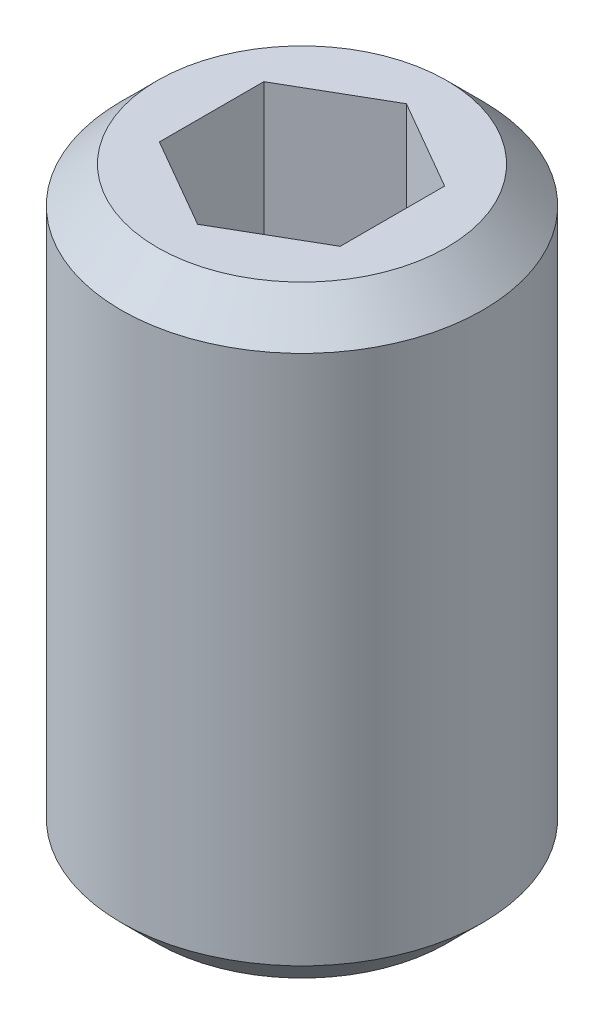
ISO-10303-21;
HEADER;
FILE_DESCRIPTION(('STEP AP214'),'2;1');
FILE_NAME('part.step','',(''),(''),'','','');
FILE_SCHEMA(('AUTOMOTIVE_DESIGN { 1 0 10303 214 1 1 1 1 }'));
ENDSEC;
DATA;
#1=APPLICATION_CONTEXT('core data for automotive mechanical design processes');
#2=APPLICATION_PROTOCOL_DEFINITION('international standard','automotive_design',2000,#1);
#3=PRODUCT_CONTEXT('',#1,'mechanical');
#4=PRODUCT('Part','Part','',(#3));
#5=PRODUCT_RELATED_PRODUCT_CATEGORY('part','',(#4));
#6=PRODUCT_DEFINITION_FORMATION('','',#4);
#7=PRODUCT_DEFINITION_CONTEXT('part definition',#1,'design');
#8=PRODUCT_DEFINITION('design','',#6,#7);
#9=PRODUCT_DEFINITION_SHAPE('','',#8);
#10=(LENGTH_UNIT() NAMED_UNIT(*) SI_UNIT(.MILLI.,.METRE.));
#11=(NAMED_UNIT(*) PLANE_ANGLE_UNIT() SI_UNIT($,.RADIAN.));
#12=(NAMED_UNIT(*) SI_UNIT($,.STERADIAN.) SOLID_ANGLE_UNIT());
#13=UNCERTAINTY_MEASURE_WITH_UNIT(LENGTH_MEASURE(1.E-05),#10,'distance_accuracy_value','');
#14=(GEOMETRIC_REPRESENTATION_CONTEXT(3) GLOBAL_UNCERTAINTY_ASSIGNED_CONTEXT((#13)) GLOBAL_UNIT_ASSIGNED_CONTEXT((#10,
#11,#12)) REPRESENTATION_CONTEXT('',''));
#15=CARTESIAN_POINT('',(0.,0.,0.));
#16=DIRECTION('',(0.,0.,1.));
#17=DIRECTION('',(1.,0.,0.));
#18=AXIS2_PLACEMENT_3D('',#15,#16,#17);
#19=CARTESIAN_POINT('',(0.,-5.,0.));
#20=DIRECTION('',(0.,1.,0.));
#21=DIRECTION('',(0.,0.,1.));
#22=AXIS2_PLACEMENT_3D('',#19,#20,#21);
#23=PLANE('',#22);
#24=CARTESIAN_POINT('',(0.,-5.,0.));
#25=DIRECTION('',(0.,1.,0.));
#26=DIRECTION('',(0.,0.,1.));
#27=AXIS2_PLACEMENT_3D('',#24,#25,#26);
#28=CIRCLE('',#27,1.2);
#29=CARTESIAN_POINT('',(0.,-5.,1.2));
#30=VERTEX_POINT('',#29);
#31=EDGE_CURVE('E139',#30,#30,#28,.F.);
#32=ORIENTED_EDGE('',*,*,#31,.T.);
#33=EDGE_LOOP('',(#32));
#34=FACE_BOUND('',#33,.T.);
#35=ADVANCED_FACE('F28',(#34),#23,.F.);
#36=CARTESIAN_POINT('',(0.,0.,0.));
#37=DIRECTION('',(0.,1.,0.));
#38=DIRECTION('',(0.,0.,1.));
#39=AXIS2_PLACEMENT_3D('',#36,#37,#38);
#40=CYLINDRICAL_SURFACE('',#39,1.5);
#41=CARTESIAN_POINT('',(0.,-0.300000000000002,0.));
#42=DIRECTION('',(0.,-1.,0.));
#43=DIRECTION('',(0.,0.,-1.));
#44=AXIS2_PLACEMENT_3D('',#41,#42,#43);
#45=CIRCLE('',#44,1.5);
#46=CARTESIAN_POINT('',(0.,-0.300000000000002,-1.5));
#47=VERTEX_POINT('',#46);
#48=EDGE_CURVE('E11',#47,#47,#45,.T.);
#49=ORIENTED_EDGE('',*,*,#48,.T.);
#50=EDGE_LOOP('',(#49));
#51=FACE_BOUND('',#50,.T.);
#52=CARTESIAN_POINT('',(0.,-4.7,0.));
#53=DIRECTION('',(0.,1.,0.));
#54=DIRECTION('',(0.,0.,1.));
#55=AXIS2_PLACEMENT_3D('',#52,#53,#54);
#56=CIRCLE('',#55,1.5);
#57=CARTESIAN_POINT('',(0.,-4.7,1.5));
#58=VERTEX_POINT('',#57);
#59=EDGE_CURVE('E130',#58,#58,#56,.T.);
#60=ORIENTED_EDGE('',*,*,#59,.T.);
#61=EDGE_LOOP('',(#60));
#62=FACE_BOUND('',#61,.T.);
#63=ADVANCED_FACE('F160',(#51,#62),#40,.T.);
#64=CARTESIAN_POINT('',(0.,0.,0.));
#65=DIRECTION('',(0.,-1.,0.));
#66=DIRECTION('',(0.,0.,-1.));
#67=AXIS2_PLACEMENT_3D('',#64,#65,#66);
#68=PLANE('',#67);
#69=DIRECTION('',(0.866025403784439,0.,-0.5));
#70=VECTOR('',#69,1.);
#71=CARTESIAN_POINT('',(0.,0.,0.866025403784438));
#72=LINE('',#71,#70);
#73=CARTESIAN_POINT('',(0.,0.,0.866025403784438));
#74=VERTEX_POINT('',#73);
#75=CARTESIAN_POINT('',(0.750000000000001,0.,0.43301270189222));
#76=VERTEX_POINT('',#75);
#77=EDGE_CURVE('E96',#74,#76,#72,.T.);
#78=ORIENTED_EDGE('',*,*,#77,.F.);
#79=DIRECTION('',(0.866025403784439,0.,0.5));
#80=VECTOR('',#79,1.);
#81=CARTESIAN_POINT('',(-0.749999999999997,0.,0.43301270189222));
#82=LINE('',#81,#80);
#83=CARTESIAN_POINT('',(-0.749999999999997,0.,0.43301270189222));
#84=VERTEX_POINT('',#83);
#85=EDGE_CURVE('E42',#84,#74,#82,.T.);
#86=ORIENTED_EDGE('',*,*,#85,.F.);
#87=DIRECTION('',(0.,0.,1.));
#88=VECTOR('',#87,1.);
#89=CARTESIAN_POINT('',(-0.749999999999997,0.,-0.433012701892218));
#90=LINE('',#89,#88);
#91=CARTESIAN_POINT('',(-0.749999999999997,0.,-0.433012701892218));
#92=VERTEX_POINT('',#91);
#93=EDGE_CURVE('E112',#92,#84,#90,.T.);
#94=ORIENTED_EDGE('',*,*,#93,.F.);
#95=DIRECTION('',(-0.866025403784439,0.,0.5));
#96=VECTOR('',#95,1.);
#97=CARTESIAN_POINT('',(0.,0.,-0.866025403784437));
#98=LINE('',#97,#96);
#99=CARTESIAN_POINT('',(0.,0.,-0.866025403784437));
#100=VERTEX_POINT('',#99);
#101=EDGE_CURVE('E106',#100,#92,#98,.T.);
#102=ORIENTED_EDGE('',*,*,#101,.F.);
#103=DIRECTION('',(-0.866025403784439,0.,-0.499999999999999));
#104=VECTOR('',#103,1.);
#105=CARTESIAN_POINT('',(0.750000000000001,0.,-0.433012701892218));
#106=LINE('',#105,#104);
#107=CARTESIAN_POINT('',(0.750000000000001,0.,-0.433012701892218));
#108=VERTEX_POINT('',#107);
#109=EDGE_CURVE('E104',#108,#100,#106,.T.);
#110=ORIENTED_EDGE('',*,*,#109,.F.);
#111=DIRECTION('',(0.,0.,-1.));
#112=VECTOR('',#111,1.);
#113=CARTESIAN_POINT('',(0.750000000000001,0.,0.43301270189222));
#114=LINE('',#113,#112);
#115=EDGE_CURVE('E85',#76,#108,#114,.T.);
#116=ORIENTED_EDGE('',*,*,#115,.F.);
#117=EDGE_LOOP('',(#78,#86,#94,#102,#110,#116));
#118=FACE_BOUND('',#117,.T.);
#119=CARTESIAN_POINT('',(0.,0.,0.));
#120=DIRECTION('',(0.,-1.,0.));
#121=DIRECTION('',(0.,0.,-1.));
#122=AXIS2_PLACEMENT_3D('',#119,#120,#121);
#123=CIRCLE('',#122,1.2);
#124=CARTESIAN_POINT('',(0.,0.,-1.2));
#125=VERTEX_POINT('',#124);
#126=EDGE_CURVE('E35',#125,#125,#123,.F.);
#127=ORIENTED_EDGE('',*,*,#126,.T.);
#128=EDGE_LOOP('',(#127));
#129=FACE_BOUND('',#128,.T.);
#130=ADVANCED_FACE('F100',(#118,#129),#68,.F.);
#131=CARTESIAN_POINT('',(0.,-4.7,0.));
#132=DIRECTION('',(0.,1.,0.));
#133=DIRECTION('',(0.,0.,1.));
#134=AXIS2_PLACEMENT_3D('',#131,#132,#133);
#135=CONICAL_SURFACE('',#134,1.5,0.78539816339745);
#136=ORIENTED_EDGE('',*,*,#31,.F.);
#137=EDGE_LOOP('',(#136));
#138=FACE_BOUND('',#137,.T.);
#139=ORIENTED_EDGE('',*,*,#59,.F.);
#140=EDGE_LOOP('',(#139));
#141=FACE_BOUND('',#140,.T.);
#142=ADVANCED_FACE('F147',(#138,#141),#135,.T.);
#143=CARTESIAN_POINT('',(0.,0.,0.));
#144=DIRECTION('',(0.,-1.,0.));
#145=DIRECTION('',(0.,0.,-1.));
#146=AXIS2_PLACEMENT_3D('',#143,#144,#145);
#147=CONICAL_SURFACE('',#146,1.2,0.785398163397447);
#148=CARTESIAN_POINT('',(0.,-0.300000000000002,-1.5));
#149=CARTESIAN_POINT('',(0.,-0.296875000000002,-1.496875));
#150=CARTESIAN_POINT('',(0.,-0.293750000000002,-1.49375));
#151=CARTESIAN_POINT('',(0.,-0.287500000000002,-1.4875));
#152=CARTESIAN_POINT('',(0.,-0.284375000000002,-1.484375));
#153=CARTESIAN_POINT('',(0.,-0.278125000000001,-1.478125));
#154=CARTESIAN_POINT('',(0.,-0.275000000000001,-1.475));
#155=CARTESIAN_POINT('',(0.,-0.268750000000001,-1.46875));
#156=CARTESIAN_POINT('',(0.,-0.265625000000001,-1.465625));
#157=CARTESIAN_POINT('',(0.,-0.259375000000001,-1.459375));
#158=CARTESIAN_POINT('',(0.,-0.256250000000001,-1.45625));
#159=CARTESIAN_POINT('',(0.,-0.250000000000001,-1.45));
#160=CARTESIAN_POINT('',(0.,-0.246875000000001,-1.446875));
#161=CARTESIAN_POINT('',(0.,-0.240625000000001,-1.440625));
#162=CARTESIAN_POINT('',(0.,-0.237500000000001,-1.4375));
#163=CARTESIAN_POINT('',(0.,-0.231250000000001,-1.43125));
#164=CARTESIAN_POINT('',(0.,-0.228125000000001,-1.428125));
#165=CARTESIAN_POINT('',(0.,-0.221875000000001,-1.421875));
#166=CARTESIAN_POINT('',(0.,-0.218750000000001,-1.41875));
#167=CARTESIAN_POINT('',(0.,-0.212500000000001,-1.4125));
#168=CARTESIAN_POINT('',(0.,-0.209375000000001,-1.409375));
#169=CARTESIAN_POINT('',(0.,-0.203125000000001,-1.403125));
#170=CARTESIAN_POINT('',(0.,-0.200000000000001,-1.4));
#171=CARTESIAN_POINT('',(0.,-0.193750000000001,-1.39375));
#172=CARTESIAN_POINT('',(0.,-0.190625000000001,-1.390625));
#173=CARTESIAN_POINT('',(0.,-0.184375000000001,-1.384375));
#174=CARTESIAN_POINT('',(0.,-0.181250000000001,-1.38125));
#175=CARTESIAN_POINT('',(0.,-0.175000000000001,-1.375));
#176=CARTESIAN_POINT('',(0.,-0.171875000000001,-1.371875));
#177=CARTESIAN_POINT('',(0.,-0.165625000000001,-1.365625));
#178=CARTESIAN_POINT('',(0.,-0.162500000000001,-1.3625));
#179=CARTESIAN_POINT('',(0.,-0.156250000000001,-1.35625));
#180=CARTESIAN_POINT('',(0.,-0.153125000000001,-1.353125));
#181=CARTESIAN_POINT('',(0.,-0.146875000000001,-1.346875));
#182=CARTESIAN_POINT('',(0.,-0.143750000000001,-1.34375));
#183=CARTESIAN_POINT('',(0.,-0.137500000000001,-1.3375));
#184=CARTESIAN_POINT('',(0.,-0.134375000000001,-1.334375));
#185=CARTESIAN_POINT('',(0.,-0.128125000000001,-1.328125));
#186=CARTESIAN_POINT('',(0.,-0.125000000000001,-1.325));
#187=CARTESIAN_POINT('',(0.,-0.118750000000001,-1.31875));
#188=CARTESIAN_POINT('',(0.,-0.115625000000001,-1.315625));
#189=CARTESIAN_POINT('',(0.,-0.109375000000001,-1.309375));
#190=CARTESIAN_POINT('',(0.,-0.106250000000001,-1.30625));
#191=CARTESIAN_POINT('',(0.,-0.100000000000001,-1.3));
#192=CARTESIAN_POINT('',(0.,-0.0968750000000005,-1.296875));
#193=CARTESIAN_POINT('',(0.,-0.0906250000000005,-1.290625));
#194=CARTESIAN_POINT('',(0.,-0.0875000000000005,-1.2875));
#195=CARTESIAN_POINT('',(0.,-0.0812500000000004,-1.28125));
#196=CARTESIAN_POINT('',(0.,-0.0781250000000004,-1.278125));
#197=CARTESIAN_POINT('',(0.,-0.0718750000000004,-1.271875));
#198=CARTESIAN_POINT('',(0.,-0.0687500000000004,-1.26875));
#199=CARTESIAN_POINT('',(0.,-0.0625000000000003,-1.2625));
#200=CARTESIAN_POINT('',(0.,-0.0593750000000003,-1.259375));
#201=CARTESIAN_POINT('',(0.,-0.0531250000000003,-1.253125));
#202=CARTESIAN_POINT('',(0.,-0.0500000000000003,-1.25));
#203=CARTESIAN_POINT('',(0.,-0.0437500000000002,-1.24375));
#204=CARTESIAN_POINT('',(0.,-0.0406250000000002,-1.240625));
#205=CARTESIAN_POINT('',(0.,-0.0343750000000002,-1.234375));
#206=CARTESIAN_POINT('',(0.,-0.0312500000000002,-1.23125));
#207=CARTESIAN_POINT('',(0.,-0.0250000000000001,-1.225));
#208=CARTESIAN_POINT('',(0.,-0.0218750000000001,-1.221875));
#209=CARTESIAN_POINT('',(0.,-0.0156250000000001,-1.215625));
#210=CARTESIAN_POINT('',(0.,-0.0125000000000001,-1.2125));
#211=CARTESIAN_POINT('',(0.,-0.00625000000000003,-1.20625));
#212=CARTESIAN_POINT('',(0.,-0.00312500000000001,-1.203125));
#213=CARTESIAN_POINT('',(0.,0.,-1.2));
#214=B_SPLINE_CURVE_WITH_KNOTS('',3,(#148,#149,#150,#151,#152,#153,#154,#155,#156,#157,#158,
#159,#160,#161,#162,#163,#164,#165,#166,#167,#168,#169,#170,#171,#172,#173,#174,#175,#176,#177,
#178,#179,#180,#181,#182,#183,#184,#185,#186,#187,#188,#189,#190,#191,#192,#193,#194,#195,#196,
#197,#198,#199,#200,#201,#202,#203,#204,#205,#206,#207,#208,#209,#210,#211,#212,#213),
.UNSPECIFIED.,.F.,.F.,(4,2,2,2,2,2,2,2,2,2,2,2,2,2,2,2,2,2,2,2,2,2,2,2,2,2,2,2,2,2,2,2,4),(0.,
0.0132582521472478,0.0265165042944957,0.0397747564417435,0.0530330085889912,0.066291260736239,
0.0795495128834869,0.0928077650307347,0.106066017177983,0.11932426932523,0.132582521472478,
0.145840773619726,0.159099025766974,0.172357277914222,0.185615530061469,0.198873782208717,
0.212132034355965,0.225390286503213,0.238648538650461,0.251906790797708,0.265165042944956,
0.278423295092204,0.291681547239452,0.3049397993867,0.318198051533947,0.331456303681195,
0.344714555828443,0.357972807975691,0.371231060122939,0.384489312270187,0.397747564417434,
0.411005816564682,0.42426406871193),.UNSPECIFIED.);
#215=EDGE_CURVE('BSEAM144',#47,#125,#214,.T.);
#216=ORIENTED_EDGE('',*,*,#48,.F.);
#217=ORIENTED_EDGE('',*,*,#126,.F.);
#218=ORIENTED_EDGE('',*,*,#215,.T.);
#219=ORIENTED_EDGE('',*,*,#215,.F.);
#220=EDGE_LOOP('',(#216,#218,#217,#219));
#221=FACE_BOUND('',#220,.T.);
#222=ADVANCED_FACE('F144',(#221),#147,.T.);
#223=CARTESIAN_POINT('',(-0.749999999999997,-2.5,0.43301270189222));
#224=DIRECTION('',(-0.5,0.,0.866025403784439));
#225=DIRECTION('',(0.866025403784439,0.,0.5));
#226=AXIS2_PLACEMENT_3D('',#223,#224,#225);
#227=PLANE('',#226);
#228=ORIENTED_EDGE('',*,*,#85,.T.);
#229=DIRECTION('',(0.,1.,0.));
#230=VECTOR('',#229,1.);
#231=CARTESIAN_POINT('',(0.,-2.5,0.866025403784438));
#232=LINE('',#231,#230);
#233=CARTESIAN_POINT('',(0.,-2.5,0.866025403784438));
#234=VERTEX_POINT('',#233);
#235=EDGE_CURVE('E93',#234,#74,#232,.T.);
#236=ORIENTED_EDGE('',*,*,#235,.F.);
#237=DIRECTION('',(0.866025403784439,0.,0.5));
#238=VECTOR('',#237,1.);
#239=CARTESIAN_POINT('',(-0.749999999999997,-2.5,0.43301270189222));
#240=LINE('',#239,#238);
#241=CARTESIAN_POINT('',(-0.749999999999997,-2.5,0.43301270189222));
#242=VERTEX_POINT('',#241);
#243=EDGE_CURVE('E114',#242,#234,#240,.T.);
#244=ORIENTED_EDGE('',*,*,#243,.F.);
#245=DIRECTION('',(0.,1.,0.));
#246=VECTOR('',#245,1.);
#247=CARTESIAN_POINT('',(-0.749999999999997,-2.5,0.43301270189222));
#248=LINE('',#247,#246);
#249=EDGE_CURVE('E49',#242,#84,#248,.T.);
#250=ORIENTED_EDGE('',*,*,#249,.T.);
#251=EDGE_LOOP('',(#228,#236,#244,#250));
#252=FACE_BOUND('',#251,.T.);
#253=ADVANCED_FACE('F146',(#252),#227,.F.);
#254=CARTESIAN_POINT('',(-0.749999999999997,-2.5,-0.433012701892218));
#255=DIRECTION('',(-1.,0.,0.));
#256=DIRECTION('',(0.,0.,1.));
#257=AXIS2_PLACEMENT_3D('',#254,#255,#256);
#258=PLANE('',#257);
#259=ORIENTED_EDGE('',*,*,#93,.T.);
#260=ORIENTED_EDGE('',*,*,#249,.F.);
#261=DIRECTION('',(0.,0.,1.));
#262=VECTOR('',#261,1.);
#263=CARTESIAN_POINT('',(-0.749999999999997,-2.5,-0.433012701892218));
#264=LINE('',#263,#262);
#265=CARTESIAN_POINT('',(-0.749999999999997,-2.5,-0.433012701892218));
#266=VERTEX_POINT('',#265);
#267=EDGE_CURVE('E126',#266,#242,#264,.T.);
#268=ORIENTED_EDGE('',*,*,#267,.F.);
#269=DIRECTION('',(0.,1.,0.));
#270=VECTOR('',#269,1.);
#271=CARTESIAN_POINT('',(-0.749999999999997,-2.5,-0.433012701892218));
#272=LINE('',#271,#270);
#273=EDGE_CURVE('E131',#266,#92,#272,.T.);
#274=ORIENTED_EDGE('',*,*,#273,.T.);
#275=EDGE_LOOP('',(#259,#260,#268,#274));
#276=FACE_BOUND('',#275,.T.);
#277=ADVANCED_FACE('F154',(#276),#258,.F.);
#278=CARTESIAN_POINT('',(0.,-2.5,-0.866025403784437));
#279=DIRECTION('',(-0.5,0.,-0.866025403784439));
#280=DIRECTION('',(-0.866025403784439,0.,0.5));
#281=AXIS2_PLACEMENT_3D('',#278,#279,#280);
#282=PLANE('',#281);
#283=ORIENTED_EDGE('',*,*,#101,.T.);
#284=ORIENTED_EDGE('',*,*,#273,.F.);
#285=DIRECTION('',(-0.866025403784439,0.,0.5));
#286=VECTOR('',#285,1.);
#287=CARTESIAN_POINT('',(0.,-2.5,-0.866025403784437));
#288=LINE('',#287,#286);
#289=CARTESIAN_POINT('',(0.,-2.5,-0.866025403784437));
#290=VERTEX_POINT('',#289);
#291=EDGE_CURVE('E123',#290,#266,#288,.T.);
#292=ORIENTED_EDGE('',*,*,#291,.F.);
#293=DIRECTION('',(0.,1.,0.));
#294=VECTOR('',#293,1.);
#295=CARTESIAN_POINT('',(0.,-2.5,-0.866025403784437));
#296=LINE('',#295,#294);
#297=EDGE_CURVE('E133',#290,#100,#296,.T.);
#298=ORIENTED_EDGE('',*,*,#297,.T.);
#299=EDGE_LOOP('',(#283,#284,#292,#298));
#300=FACE_BOUND('',#299,.T.);
#301=ADVANCED_FACE('F199',(#300),#282,.F.);
#302=CARTESIAN_POINT('',(0.750000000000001,-2.5,-0.433012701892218));
#303=DIRECTION('',(0.499999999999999,0.,-0.866025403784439));
#304=DIRECTION('',(-0.866025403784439,0.,-0.499999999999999));
#305=AXIS2_PLACEMENT_3D('',#302,#303,#304);
#306=PLANE('',#305);
#307=ORIENTED_EDGE('',*,*,#109,.T.);
#308=ORIENTED_EDGE('',*,*,#297,.F.);
#309=DIRECTION('',(-0.866025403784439,0.,-0.499999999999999));
#310=VECTOR('',#309,1.);
#311=CARTESIAN_POINT('',(0.750000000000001,-2.5,-0.433012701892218));
#312=LINE('',#311,#310);
#313=CARTESIAN_POINT('',(0.750000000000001,-2.5,-0.433012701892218));
#314=VERTEX_POINT('',#313);
#315=EDGE_CURVE('E120',#314,#290,#312,.T.);
#316=ORIENTED_EDGE('',*,*,#315,.F.);
#317=DIRECTION('',(0.,1.,0.));
#318=VECTOR('',#317,1.);
#319=CARTESIAN_POINT('',(0.750000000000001,-2.5,-0.433012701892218));
#320=LINE('',#319,#318);
#321=EDGE_CURVE('E92',#314,#108,#320,.T.);
#322=ORIENTED_EDGE('',*,*,#321,.T.);
#323=EDGE_LOOP('',(#307,#308,#316,#322));
#324=FACE_BOUND('',#323,.T.);
#325=ADVANCED_FACE('F208',(#324),#306,.F.);
#326=CARTESIAN_POINT('',(0.750000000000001,-2.5,0.43301270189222));
#327=DIRECTION('',(1.,0.,0.));
#328=DIRECTION('',(0.,0.,-1.));
#329=AXIS2_PLACEMENT_3D('',#326,#327,#328);
#330=PLANE('',#329);
#331=ORIENTED_EDGE('',*,*,#115,.T.);
#332=ORIENTED_EDGE('',*,*,#321,.F.);
#333=DIRECTION('',(0.,0.,-1.));
#334=VECTOR('',#333,1.);
#335=CARTESIAN_POINT('',(0.750000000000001,-2.5,0.43301270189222));
#336=LINE('',#335,#334);
#337=CARTESIAN_POINT('',(0.750000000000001,-2.5,0.43301270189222));
#338=VERTEX_POINT('',#337);
#339=EDGE_CURVE('E88',#338,#314,#336,.T.);
#340=ORIENTED_EDGE('',*,*,#339,.F.);
#341=DIRECTION('',(0.,1.,0.));
#342=VECTOR('',#341,1.);
#343=CARTESIAN_POINT('',(0.750000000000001,-2.5,0.43301270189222));
#344=LINE('',#343,#342);
#345=EDGE_CURVE('E81',#338,#76,#344,.T.);
#346=ORIENTED_EDGE('',*,*,#345,.T.);
#347=EDGE_LOOP('',(#331,#332,#340,#346));
#348=FACE_BOUND('',#347,.T.);
#349=ADVANCED_FACE('F83',(#348),#330,.F.);
#350=CARTESIAN_POINT('',(0.,-2.5,0.866025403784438));
#351=DIRECTION('',(0.5,0.,0.866025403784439));
#352=DIRECTION('',(0.866025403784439,0.,-0.5));
#353=AXIS2_PLACEMENT_3D('',#350,#351,#352);
#354=PLANE('',#353);
#355=ORIENTED_EDGE('',*,*,#77,.T.);
#356=ORIENTED_EDGE('',*,*,#345,.F.);
#357=DIRECTION('',(0.866025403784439,0.,-0.5));
#358=VECTOR('',#357,1.);
#359=CARTESIAN_POINT('',(0.,-2.5,0.866025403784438));
#360=LINE('',#359,#358);
#361=EDGE_CURVE('E117',#234,#338,#360,.T.);
#362=ORIENTED_EDGE('',*,*,#361,.F.);
#363=ORIENTED_EDGE('',*,*,#235,.T.);
#364=EDGE_LOOP('',(#355,#356,#362,#363));
#365=FACE_BOUND('',#364,.T.);
#366=ADVANCED_FACE('F97',(#365),#354,.F.);
#367=CARTESIAN_POINT('',(0.750000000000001,-2.5,1.29903810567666));
#368=DIRECTION('',(0.,1.,0.));
#369=DIRECTION('',(0.,0.,1.));
#370=AXIS2_PLACEMENT_3D('',#367,#368,#369);
#371=PLANE('',#370);
#372=ORIENTED_EDGE('',*,*,#243,.T.);
#373=ORIENTED_EDGE('',*,*,#361,.T.);
#374=ORIENTED_EDGE('',*,*,#339,.T.);
#375=ORIENTED_EDGE('',*,*,#315,.T.);
#376=ORIENTED_EDGE('',*,*,#291,.T.);
#377=ORIENTED_EDGE('',*,*,#267,.T.);
#378=EDGE_LOOP('',(#372,#373,#374,#375,#376,#377));
#379=FACE_BOUND('',#378,.T.);
#380=ADVANCED_FACE('F235',(#379),#371,.T.);
#381=CLOSED_SHELL('',(#35,#63,#130,#142,#222,#253,#277,#301,#325,#349,#366,#380));
#382=MANIFOLD_SOLID_BREP('B2',#381);
#383=ADVANCED_BREP_SHAPE_REPRESENTATION('',(#18,#382),#14);
#384=SHAPE_DEFINITION_REPRESENTATION(#9,#383);
ENDSEC;
END-ISO-10303-21;
